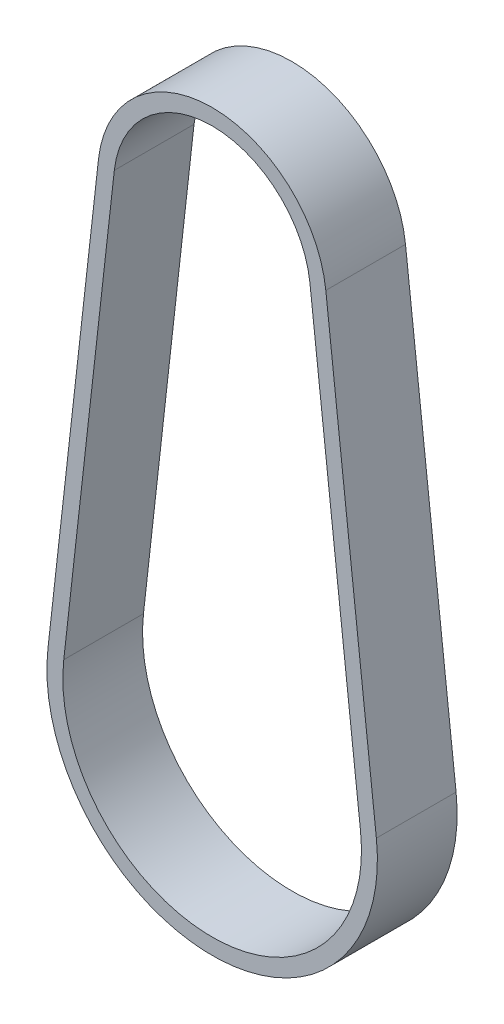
from build123d import *

# Parameters (mm, degrees)
EXTRUDE_THIN1_DEPTH = 7.5


with BuildPart() as part:
    # Sketch2 → Extrude-Thin1 (new, symmetric)
    with BuildSketch(Plane.XY):
        with BuildLine():
            Line((-30.904750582, -82.104425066), (-21.389863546, 2.408186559))
            ThreePointArc((-21.389863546, 2.408186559), (0, 21.525), (21.389863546, 2.408186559))
            Line((21.389863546, 2.408186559), (30.904750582, -82.104425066))
            ThreePointArc((30.904750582, -82.104425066), (0, -116.683849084), (-30.904750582, -82.104425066))
        make_face()
        with BuildLine():
            Line((-27.923584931, -82.440060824), (-18.408697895, 2.072550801))
            ThreePointArc((-18.408697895, 2.072550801), (0, 18.525), (18.408697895, 2.072550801))
            Line((18.408697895, 2.072550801), (27.923584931, -82.440060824))
            ThreePointArc((27.923584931, -82.440060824), (0, -113.683849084), (-27.923584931, -82.440060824))
        make_face(mode=Mode.SUBTRACT)
    extrude(amount=EXTRUDE_THIN1_DEPTH, both=True)


solid = part.part
